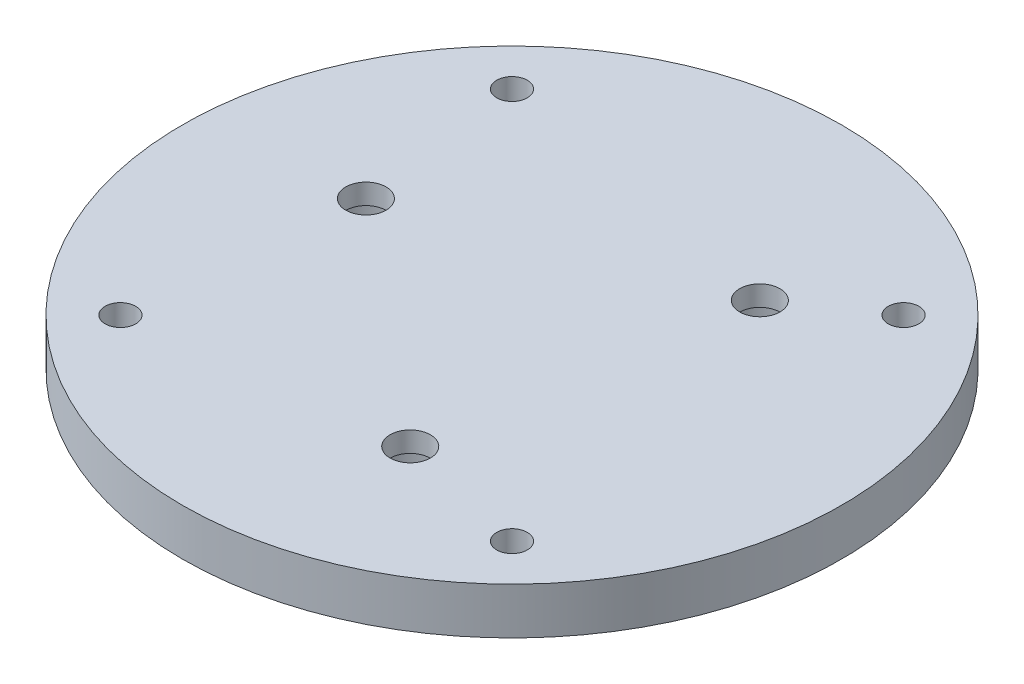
from build123d import *

# Parameters (mm, degrees)
SKETCH1_R                               = 44.8945
BOSS_EXTRUDE1_DEPTH                     = 6.35
F_8_32_TAPPED_HOLE1_D                   = 4.1656
CBORE_FOR_M5_HEX_HEAD_BOLT1_D           = 5.5
CBORE_FOR_M5_HEX_HEAD_BOLT1_CBORE_D     = 12.24
CBORE_FOR_M5_HEX_HEAD_BOLT1_CBORE_DEPTH = 3.58


with BuildPart() as part:
    # Sketch1 → Boss-Extrude1 (new body)
    with BuildSketch(Plane(origin=(0, 0, 0), x_dir=(1, 0, 0), z_dir=(0, 1, 0))):
        with Locations(Location((0, 0, 0), (0, 0, 270))):
            Circle(SKETCH1_R)
    extrude(amount=BOSS_EXTRUDE1_DEPTH)

    # 8-32 Tapped Hole1 (through all)
    with Locations(Plane(origin=(0, 6.35, 0), x_dir=(1, 0, 0), z_dir=(0, 1, 0))):
        with Locations((-26.67, 26.67), (26.67, 26.67), (-26.67, -26.67), (26.67, -26.67)):
            Hole(F_8_32_TAPPED_HOLE1_D / 2)

    # CBORE for M5 Hex Head Bolt1 (through all)
    with Locations(Plane(origin=(0, 0, 0), x_dir=(-1, 0, 0), z_dir=(0, -1, 0))):
        with Locations((-15.138298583, 18.623423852), (-8.559208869, -22.42186307), (23.697507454, 3.798439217)):
            CounterBoreHole(CBORE_FOR_M5_HEX_HEAD_BOLT1_D / 2, CBORE_FOR_M5_HEX_HEAD_BOLT1_CBORE_D / 2, CBORE_FOR_M5_HEX_HEAD_BOLT1_CBORE_DEPTH)


solid = part.part
